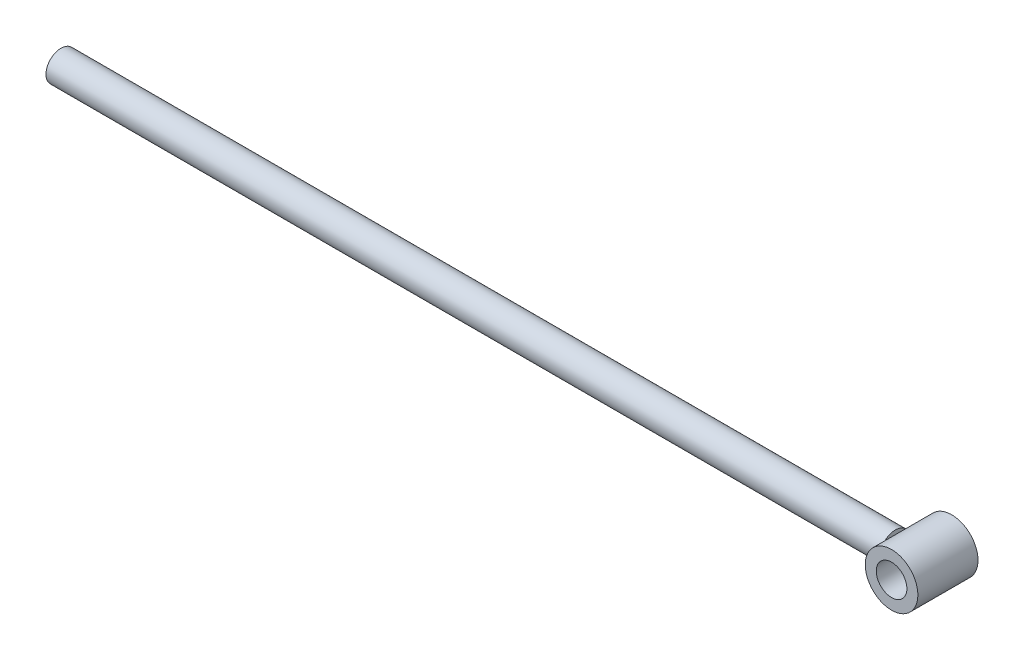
ISO-10303-21;
HEADER;
FILE_DESCRIPTION(('STEP AP214'),'2;1');
FILE_NAME('part.step','',(''),(''),'','','');
FILE_SCHEMA(('AUTOMOTIVE_DESIGN { 1 0 10303 214 1 1 1 1 }'));
ENDSEC;
DATA;
#1=APPLICATION_CONTEXT('core data for automotive mechanical design processes');
#2=APPLICATION_PROTOCOL_DEFINITION('international standard','automotive_design',2000,#1);
#3=PRODUCT_CONTEXT('',#1,'mechanical');
#4=PRODUCT('Part','Part','',(#3));
#5=PRODUCT_RELATED_PRODUCT_CATEGORY('part','',(#4));
#6=PRODUCT_DEFINITION_FORMATION('','',#4);
#7=PRODUCT_DEFINITION_CONTEXT('part definition',#1,'design');
#8=PRODUCT_DEFINITION('design','',#6,#7);
#9=PRODUCT_DEFINITION_SHAPE('','',#8);
#10=(LENGTH_UNIT() NAMED_UNIT(*) SI_UNIT(.MILLI.,.METRE.));
#11=(NAMED_UNIT(*) PLANE_ANGLE_UNIT() SI_UNIT($,.RADIAN.));
#12=(NAMED_UNIT(*) SI_UNIT($,.STERADIAN.) SOLID_ANGLE_UNIT());
#13=UNCERTAINTY_MEASURE_WITH_UNIT(LENGTH_MEASURE(1.E-05),#10,'distance_accuracy_value','');
#14=(GEOMETRIC_REPRESENTATION_CONTEXT(3) GLOBAL_UNCERTAINTY_ASSIGNED_CONTEXT((#13)) GLOBAL_UNIT_ASSIGNED_CONTEXT((#10,
#11,#12)) REPRESENTATION_CONTEXT('',''));
#15=CARTESIAN_POINT('',(0.,0.,0.));
#16=DIRECTION('',(0.,0.,1.));
#17=DIRECTION('',(1.,0.,0.));
#18=AXIS2_PLACEMENT_3D('',#15,#16,#17);
#19=CARTESIAN_POINT('',(572.5,0.,20.));
#20=DIRECTION('',(0.,0.,1.));
#21=DIRECTION('',(1.,0.,0.));
#22=AXIS2_PLACEMENT_3D('',#19,#20,#21);
#23=PLANE('',#22);
#24=CARTESIAN_POINT('',(572.5,0.,20.));
#25=DIRECTION('',(0.,0.,1.));
#26=DIRECTION('',(1.,0.,0.));
#27=AXIS2_PLACEMENT_3D('',#24,#25,#26);
#28=CIRCLE('',#27,17.4999999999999);
#29=CARTESIAN_POINT('',(590.,0.,20.));
#30=VERTEX_POINT('',#29);
#31=EDGE_CURVE('E11',#30,#30,#28,.T.);
#32=ORIENTED_EDGE('',*,*,#31,.T.);
#33=EDGE_LOOP('',(#32));
#34=FACE_BOUND('',#33,.T.);
#35=CARTESIAN_POINT('',(572.5,0.,20.));
#36=DIRECTION('',(0.,0.,1.));
#37=DIRECTION('',(1.,0.,0.));
#38=AXIS2_PLACEMENT_3D('',#35,#36,#37);
#39=CIRCLE('',#38,10.2);
#40=CARTESIAN_POINT('',(582.7,0.,20.));
#41=VERTEX_POINT('',#40);
#42=EDGE_CURVE('E47',#41,#41,#39,.T.);
#43=ORIENTED_EDGE('',*,*,#42,.F.);
#44=EDGE_LOOP('',(#43));
#45=FACE_BOUND('',#44,.T.);
#46=ADVANCED_FACE('F36',(#34,#45),#23,.T.);
#47=CARTESIAN_POINT('',(572.5,0.,-20.));
#48=DIRECTION('',(0.,0.,1.));
#49=DIRECTION('',(1.,0.,0.));
#50=AXIS2_PLACEMENT_3D('',#47,#48,#49);
#51=PLANE('',#50);
#52=CARTESIAN_POINT('',(572.5,0.,-20.));
#53=DIRECTION('',(0.,0.,1.));
#54=DIRECTION('',(1.,0.,0.));
#55=AXIS2_PLACEMENT_3D('',#52,#53,#54);
#56=CIRCLE('',#55,17.4999999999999);
#57=CARTESIAN_POINT('',(590.,0.,-20.));
#58=VERTEX_POINT('',#57);
#59=EDGE_CURVE('E43',#58,#58,#56,.T.);
#60=ORIENTED_EDGE('',*,*,#59,.F.);
#61=EDGE_LOOP('',(#60));
#62=FACE_BOUND('',#61,.T.);
#63=CARTESIAN_POINT('',(572.5,0.,-20.));
#64=DIRECTION('',(0.,0.,1.));
#65=DIRECTION('',(1.,0.,0.));
#66=AXIS2_PLACEMENT_3D('',#63,#64,#65);
#67=CIRCLE('',#66,10.2);
#68=CARTESIAN_POINT('',(582.7,0.,-20.));
#69=VERTEX_POINT('',#68);
#70=EDGE_CURVE('E51',#69,#69,#67,.T.);
#71=ORIENTED_EDGE('',*,*,#70,.T.);
#72=EDGE_LOOP('',(#71));
#73=FACE_BOUND('',#72,.T.);
#74=ADVANCED_FACE('F57',(#62,#73),#51,.F.);
#75=CARTESIAN_POINT('',(572.5,0.,20.));
#76=DIRECTION('',(0.,0.,-1.));
#77=DIRECTION('',(-1.,0.,0.));
#78=AXIS2_PLACEMENT_3D('',#75,#76,#77);
#79=CYLINDRICAL_SURFACE('',#78,17.4999999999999);
#80=ORIENTED_EDGE('',*,*,#31,.F.);
#81=EDGE_LOOP('',(#80));
#82=FACE_BOUND('',#81,.T.);
#83=ORIENTED_EDGE('',*,*,#59,.T.);
#84=EDGE_LOOP('',(#83));
#85=FACE_BOUND('',#84,.T.);
#86=ADVANCED_FACE('F38',(#82,#85),#79,.T.);
#87=CARTESIAN_POINT('',(572.5,0.,20.));
#88=DIRECTION('',(0.,0.,-1.));
#89=DIRECTION('',(-1.,0.,0.));
#90=AXIS2_PLACEMENT_3D('',#87,#88,#89);
#91=CYLINDRICAL_SURFACE('',#90,10.2);
#92=ORIENTED_EDGE('',*,*,#42,.T.);
#93=EDGE_LOOP('',(#92));
#94=FACE_BOUND('',#93,.T.);
#95=ORIENTED_EDGE('',*,*,#70,.F.);
#96=EDGE_LOOP('',(#95));
#97=FACE_BOUND('',#96,.T.);
#98=ADVANCED_FACE('F59',(#94,#97),#91,.F.);
#99=CLOSED_SHELL('',(#46,#74,#86,#98));
#100=MANIFOLD_SOLID_BREP('B2',#99);
#101=CARTESIAN_POINT('',(555.,0.,0.));
#102=DIRECTION('',(-1.,0.,0.));
#103=DIRECTION('',(0.,0.,1.));
#104=AXIS2_PLACEMENT_3D('',#101,#102,#103);
#105=CYLINDRICAL_SURFACE('',#104,10.);
#106=CARTESIAN_POINT('',(555.,0.,0.));
#107=DIRECTION('',(1.,0.,0.));
#108=DIRECTION('',(0.,0.,-1.));
#109=AXIS2_PLACEMENT_3D('',#106,#107,#108);
#110=CIRCLE('',#109,10.);
#111=CARTESIAN_POINT('',(555.,0.,-10.));
#112=VERTEX_POINT('',#111);
#113=EDGE_CURVE('E35',#112,#112,#110,.T.);
#114=ORIENTED_EDGE('',*,*,#113,.F.);
#115=EDGE_LOOP('',(#114));
#116=FACE_BOUND('',#115,.T.);
#117=CARTESIAN_POINT('',(0.,0.,0.));
#118=DIRECTION('',(1.,0.,0.));
#119=DIRECTION('',(0.,0.,-1.));
#120=AXIS2_PLACEMENT_3D('',#117,#118,#119);
#121=CIRCLE('',#120,10.);
#122=CARTESIAN_POINT('',(0.,0.,-10.));
#123=VERTEX_POINT('',#122);
#124=EDGE_CURVE('E103',#123,#123,#121,.T.);
#125=ORIENTED_EDGE('',*,*,#124,.T.);
#126=EDGE_LOOP('',(#125));
#127=FACE_BOUND('',#126,.T.);
#128=ADVANCED_FACE('F97',(#116,#127),#105,.T.);
#129=CARTESIAN_POINT('',(555.,0.,0.));
#130=DIRECTION('',(1.,0.,0.));
#131=DIRECTION('',(0.,0.,-1.));
#132=AXIS2_PLACEMENT_3D('',#129,#130,#131);
#133=PLANE('',#132);
#134=ORIENTED_EDGE('',*,*,#113,.T.);
#135=EDGE_LOOP('',(#134));
#136=FACE_BOUND('',#135,.T.);
#137=ADVANCED_FACE('F112',(#136),#133,.T.);
#138=CARTESIAN_POINT('',(0.,0.,0.));
#139=DIRECTION('',(1.,0.,0.));
#140=DIRECTION('',(0.,0.,-1.));
#141=AXIS2_PLACEMENT_3D('',#138,#139,#140);
#142=PLANE('',#141);
#143=ORIENTED_EDGE('',*,*,#124,.F.);
#144=EDGE_LOOP('',(#143));
#145=FACE_BOUND('',#144,.T.);
#146=ADVANCED_FACE('F110',(#145),#142,.F.);
#147=CLOSED_SHELL('',(#128,#137,#146));
#148=MANIFOLD_SOLID_BREP('B6',#147);
#149=ADVANCED_BREP_SHAPE_REPRESENTATION('',(#18,#100,#148),#14);
#150=SHAPE_DEFINITION_REPRESENTATION(#9,#149);
ENDSEC;
END-ISO-10303-21;
